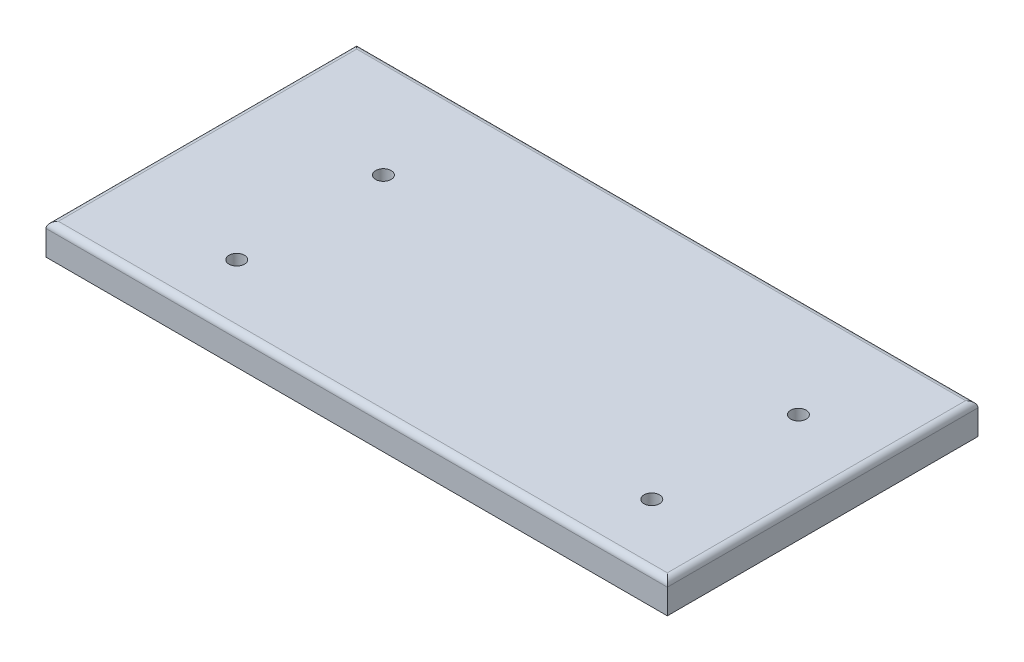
ISO-10303-21;
HEADER;
FILE_DESCRIPTION(('STEP AP214'),'2;1');
FILE_NAME('part.step','',(''),(''),'','','');
FILE_SCHEMA(('AUTOMOTIVE_DESIGN { 1 0 10303 214 1 1 1 1 }'));
ENDSEC;
DATA;
#1=APPLICATION_CONTEXT('core data for automotive mechanical design processes');
#2=APPLICATION_PROTOCOL_DEFINITION('international standard','automotive_design',2000,#1);
#3=PRODUCT_CONTEXT('',#1,'mechanical');
#4=PRODUCT('Part','Part','',(#3));
#5=PRODUCT_RELATED_PRODUCT_CATEGORY('part','',(#4));
#6=PRODUCT_DEFINITION_FORMATION('','',#4);
#7=PRODUCT_DEFINITION_CONTEXT('part definition',#1,'design');
#8=PRODUCT_DEFINITION('design','',#6,#7);
#9=PRODUCT_DEFINITION_SHAPE('','',#8);
#10=(LENGTH_UNIT() NAMED_UNIT(*) SI_UNIT(.MILLI.,.METRE.));
#11=(NAMED_UNIT(*) PLANE_ANGLE_UNIT() SI_UNIT($,.RADIAN.));
#12=(NAMED_UNIT(*) SI_UNIT($,.STERADIAN.) SOLID_ANGLE_UNIT());
#13=UNCERTAINTY_MEASURE_WITH_UNIT(LENGTH_MEASURE(1.E-05),#10,'distance_accuracy_value','');
#14=(GEOMETRIC_REPRESENTATION_CONTEXT(3) GLOBAL_UNCERTAINTY_ASSIGNED_CONTEXT((#13)) GLOBAL_UNIT_ASSIGNED_CONTEXT((#10,
#11,#12)) REPRESENTATION_CONTEXT('',''));
#15=CARTESIAN_POINT('',(0.,0.,0.));
#16=DIRECTION('',(0.,0.,1.));
#17=DIRECTION('',(1.,0.,0.));
#18=AXIS2_PLACEMENT_3D('',#15,#16,#17);
#19=CARTESIAN_POINT('',(0.,12.7,0.));
#20=DIRECTION('',(-1.,0.,0.));
#21=DIRECTION('',(0.,0.,1.));
#22=AXIS2_PLACEMENT_3D('',#19,#20,#21);
#23=PLANE('',#22);
#24=DIRECTION('',(0.,-1.,0.));
#25=VECTOR('',#24,1.);
#26=CARTESIAN_POINT('',(0.,12.7,-127.));
#27=LINE('',#26,#25);
#28=CARTESIAN_POINT('',(0.,10.16,-127.));
#29=VERTEX_POINT('',#28);
#30=CARTESIAN_POINT('',(0.,0.,-127.));
#31=VERTEX_POINT('',#30);
#32=EDGE_CURVE('E81',#29,#31,#27,.T.);
#33=ORIENTED_EDGE('',*,*,#32,.F.);
#34=DIRECTION('',(0.,0.,-1.));
#35=VECTOR('',#34,1.);
#36=CARTESIAN_POINT('',(0.,10.16,0.));
#37=LINE('',#36,#35);
#38=CARTESIAN_POINT('',(0.,10.16,0.));
#39=VERTEX_POINT('',#38);
#40=EDGE_CURVE('E130',#29,#39,#37,.F.);
#41=ORIENTED_EDGE('',*,*,#40,.T.);
#42=DIRECTION('',(0.,-1.,0.));
#43=VECTOR('',#42,1.);
#44=CARTESIAN_POINT('',(0.,12.7,0.));
#45=LINE('',#44,#43);
#46=CARTESIAN_POINT('',(0.,0.,0.));
#47=VERTEX_POINT('',#46);
#48=EDGE_CURVE('E101',#39,#47,#45,.T.);
#49=ORIENTED_EDGE('',*,*,#48,.T.);
#50=DIRECTION('',(0.,0.,-1.));
#51=VECTOR('',#50,1.);
#52=CARTESIAN_POINT('',(0.,0.,0.));
#53=LINE('',#52,#51);
#54=EDGE_CURVE('E96',#47,#31,#53,.T.);
#55=ORIENTED_EDGE('',*,*,#54,.T.);
#56=EDGE_LOOP('',(#33,#41,#49,#55));
#57=FACE_BOUND('',#56,.T.);
#58=ADVANCED_FACE('F30',(#57),#23,.F.);
#59=CARTESIAN_POINT('',(0.,12.7,-127.));
#60=DIRECTION('',(0.,0.,1.));
#61=DIRECTION('',(1.,0.,0.));
#62=AXIS2_PLACEMENT_3D('',#59,#60,#61);
#63=PLANE('',#62);
#64=DIRECTION('',(0.,-1.,0.));
#65=VECTOR('',#64,1.);
#66=CARTESIAN_POINT('',(-254.,12.7,-127.));
#67=LINE('',#66,#65);
#68=CARTESIAN_POINT('',(-254.,10.16,-127.));
#69=VERTEX_POINT('',#68);
#70=CARTESIAN_POINT('',(-254.,0.,-127.));
#71=VERTEX_POINT('',#70);
#72=EDGE_CURVE('E90',#69,#71,#67,.T.);
#73=ORIENTED_EDGE('',*,*,#72,.F.);
#74=DIRECTION('',(-1.,0.,0.));
#75=VECTOR('',#74,1.);
#76=CARTESIAN_POINT('',(0.,10.16,-127.));
#77=LINE('',#76,#75);
#78=EDGE_CURVE('E39',#69,#29,#77,.F.);
#79=ORIENTED_EDGE('',*,*,#78,.T.);
#80=ORIENTED_EDGE('',*,*,#32,.T.);
#81=DIRECTION('',(-1.,0.,0.));
#82=VECTOR('',#81,1.);
#83=CARTESIAN_POINT('',(0.,0.,-127.));
#84=LINE('',#83,#82);
#85=EDGE_CURVE('E84',#31,#71,#84,.T.);
#86=ORIENTED_EDGE('',*,*,#85,.T.);
#87=EDGE_LOOP('',(#73,#79,#80,#86));
#88=FACE_BOUND('',#87,.T.);
#89=ADVANCED_FACE('F83',(#88),#63,.F.);
#90=CARTESIAN_POINT('',(-254.,12.7,0.));
#91=DIRECTION('',(1.,0.,0.));
#92=DIRECTION('',(0.,0.,-1.));
#93=AXIS2_PLACEMENT_3D('',#90,#91,#92);
#94=PLANE('',#93);
#95=DIRECTION('',(0.,-1.,0.));
#96=VECTOR('',#95,1.);
#97=CARTESIAN_POINT('',(-254.,12.7,0.));
#98=LINE('',#97,#96);
#99=CARTESIAN_POINT('',(-254.,10.16,0.));
#100=VERTEX_POINT('',#99);
#101=CARTESIAN_POINT('',(-254.,0.,0.));
#102=VERTEX_POINT('',#101);
#103=EDGE_CURVE('E116',#100,#102,#98,.T.);
#104=ORIENTED_EDGE('',*,*,#103,.F.);
#105=DIRECTION('',(0.,0.,1.));
#106=VECTOR('',#105,1.);
#107=CARTESIAN_POINT('',(-254.,10.16,-127.));
#108=LINE('',#107,#106);
#109=EDGE_CURVE('E11',#100,#69,#108,.F.);
#110=ORIENTED_EDGE('',*,*,#109,.T.);
#111=ORIENTED_EDGE('',*,*,#72,.T.);
#112=DIRECTION('',(0.,0.,1.));
#113=VECTOR('',#112,1.);
#114=CARTESIAN_POINT('',(-254.,0.,0.));
#115=LINE('',#114,#113);
#116=EDGE_CURVE('E98',#71,#102,#115,.T.);
#117=ORIENTED_EDGE('',*,*,#116,.T.);
#118=EDGE_LOOP('',(#104,#110,#111,#117));
#119=FACE_BOUND('',#118,.T.);
#120=ADVANCED_FACE('F180',(#119),#94,.F.);
#121=CARTESIAN_POINT('',(0.,12.7,0.));
#122=DIRECTION('',(0.,0.,-1.));
#123=DIRECTION('',(-1.,0.,0.));
#124=AXIS2_PLACEMENT_3D('',#121,#122,#123);
#125=PLANE('',#124);
#126=ORIENTED_EDGE('',*,*,#48,.F.);
#127=DIRECTION('',(1.,0.,0.));
#128=VECTOR('',#127,1.);
#129=CARTESIAN_POINT('',(-254.,10.16,0.));
#130=LINE('',#129,#128);
#131=EDGE_CURVE('E127',#39,#100,#130,.F.);
#132=ORIENTED_EDGE('',*,*,#131,.T.);
#133=ORIENTED_EDGE('',*,*,#103,.T.);
#134=DIRECTION('',(1.,0.,0.));
#135=VECTOR('',#134,1.);
#136=CARTESIAN_POINT('',(0.,0.,0.));
#137=LINE('',#136,#135);
#138=EDGE_CURVE('E113',#102,#47,#137,.T.);
#139=ORIENTED_EDGE('',*,*,#138,.T.);
#140=EDGE_LOOP('',(#126,#132,#133,#139));
#141=FACE_BOUND('',#140,.T.);
#142=ADVANCED_FACE('F208',(#141),#125,.F.);
#143=CARTESIAN_POINT('',(0.,12.7,-127.));
#144=DIRECTION('',(0.,1.,0.));
#145=DIRECTION('',(0.,0.,1.));
#146=AXIS2_PLACEMENT_3D('',#143,#144,#145);
#147=PLANE('',#146);
#148=CARTESIAN_POINT('',(-201.422,12.7,-85.344));
#149=DIRECTION('',(0.,1.,0.));
#150=DIRECTION('',(0.,0.,1.));
#151=AXIS2_PLACEMENT_3D('',#148,#149,#150);
#152=CIRCLE('',#151,3.17499999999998);
#153=CARTESIAN_POINT('',(-201.422,12.7,-82.169));
#154=VERTEX_POINT('',#153);
#155=EDGE_CURVE('E156',#154,#154,#152,.T.);
#156=ORIENTED_EDGE('',*,*,#155,.F.);
#157=EDGE_LOOP('',(#156));
#158=FACE_BOUND('',#157,.T.);
#159=CARTESIAN_POINT('',(-31.75,12.7,-85.344));
#160=DIRECTION('',(0.,1.,0.));
#161=DIRECTION('',(0.,0.,1.));
#162=AXIS2_PLACEMENT_3D('',#159,#160,#161);
#163=CIRCLE('',#162,3.175);
#164=CARTESIAN_POINT('',(-31.75,12.7,-82.169));
#165=VERTEX_POINT('',#164);
#166=EDGE_CURVE('E151',#165,#165,#163,.T.);
#167=ORIENTED_EDGE('',*,*,#166,.F.);
#168=EDGE_LOOP('',(#167));
#169=FACE_BOUND('',#168,.T.);
#170=CARTESIAN_POINT('',(-31.75,12.7,-25.4));
#171=DIRECTION('',(0.,1.,0.));
#172=DIRECTION('',(0.,0.,1.));
#173=AXIS2_PLACEMENT_3D('',#170,#171,#172);
#174=CIRCLE('',#173,3.175);
#175=CARTESIAN_POINT('',(-31.75,12.7,-22.225));
#176=VERTEX_POINT('',#175);
#177=EDGE_CURVE('E141',#176,#176,#174,.T.);
#178=ORIENTED_EDGE('',*,*,#177,.F.);
#179=EDGE_LOOP('',(#178));
#180=FACE_BOUND('',#179,.T.);
#181=CARTESIAN_POINT('',(-201.422,12.7,-25.4));
#182=DIRECTION('',(0.,1.,0.));
#183=DIRECTION('',(0.,0.,1.));
#184=AXIS2_PLACEMENT_3D('',#181,#182,#183);
#185=CIRCLE('',#184,3.17499999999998);
#186=CARTESIAN_POINT('',(-201.422,12.7,-22.225));
#187=VERTEX_POINT('',#186);
#188=EDGE_CURVE('E140',#187,#187,#185,.T.);
#189=ORIENTED_EDGE('',*,*,#188,.F.);
#190=EDGE_LOOP('',(#189));
#191=FACE_BOUND('',#190,.T.);
#192=DIRECTION('',(0.,0.,1.));
#193=VECTOR('',#192,1.);
#194=CARTESIAN_POINT('',(-251.46,12.7,0.));
#195=LINE('',#194,#193);
#196=CARTESIAN_POINT('',(-251.46,12.7,-124.46));
#197=VERTEX_POINT('',#196);
#198=CARTESIAN_POINT('',(-251.46,12.7,-2.53999999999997));
#199=VERTEX_POINT('',#198);
#200=EDGE_CURVE('E89',#197,#199,#195,.T.);
#201=ORIENTED_EDGE('',*,*,#200,.T.);
#202=DIRECTION('',(1.,0.,0.));
#203=VECTOR('',#202,1.);
#204=CARTESIAN_POINT('',(0.,12.7,-2.54));
#205=LINE('',#204,#203);
#206=CARTESIAN_POINT('',(-2.54,12.7,-2.54));
#207=VERTEX_POINT('',#206);
#208=EDGE_CURVE('E124',#199,#207,#205,.T.);
#209=ORIENTED_EDGE('',*,*,#208,.T.);
#210=DIRECTION('',(0.,0.,-1.));
#211=VECTOR('',#210,1.);
#212=CARTESIAN_POINT('',(-2.54,12.7,-127.));
#213=LINE('',#212,#211);
#214=CARTESIAN_POINT('',(-2.54,12.7,-124.46));
#215=VERTEX_POINT('',#214);
#216=EDGE_CURVE('E122',#207,#215,#213,.T.);
#217=ORIENTED_EDGE('',*,*,#216,.T.);
#218=DIRECTION('',(-1.,0.,0.));
#219=VECTOR('',#218,1.);
#220=CARTESIAN_POINT('',(-254.,12.7,-124.46));
#221=LINE('',#220,#219);
#222=EDGE_CURVE('E120',#215,#197,#221,.T.);
#223=ORIENTED_EDGE('',*,*,#222,.T.);
#224=EDGE_LOOP('',(#201,#209,#217,#223));
#225=FACE_BOUND('',#224,.T.);
#226=ADVANCED_FACE('F211',(#158,#169,#180,#191,#225),#147,.T.);
#227=CARTESIAN_POINT('',(0.,0.,-127.));
#228=DIRECTION('',(0.,1.,0.));
#229=DIRECTION('',(0.,0.,1.));
#230=AXIS2_PLACEMENT_3D('',#227,#228,#229);
#231=PLANE('',#230);
#232=CARTESIAN_POINT('',(-201.422,0.,-85.344));
#233=DIRECTION('',(0.,1.,0.));
#234=DIRECTION('',(0.,0.,1.));
#235=AXIS2_PLACEMENT_3D('',#232,#233,#234);
#236=CIRCLE('',#235,3.17499999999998);
#237=CARTESIAN_POINT('',(-201.422,0.,-82.169));
#238=VERTEX_POINT('',#237);
#239=EDGE_CURVE('E34',#238,#238,#236,.T.);
#240=ORIENTED_EDGE('',*,*,#239,.T.);
#241=EDGE_LOOP('',(#240));
#242=FACE_BOUND('',#241,.T.);
#243=CARTESIAN_POINT('',(-31.75,0.,-85.344));
#244=DIRECTION('',(0.,1.,0.));
#245=DIRECTION('',(0.,0.,1.));
#246=AXIS2_PLACEMENT_3D('',#243,#244,#245);
#247=CIRCLE('',#246,3.175);
#248=CARTESIAN_POINT('',(-31.75,0.,-82.169));
#249=VERTEX_POINT('',#248);
#250=EDGE_CURVE('E146',#249,#249,#247,.T.);
#251=ORIENTED_EDGE('',*,*,#250,.T.);
#252=EDGE_LOOP('',(#251));
#253=FACE_BOUND('',#252,.T.);
#254=CARTESIAN_POINT('',(-31.75,0.,-25.4));
#255=DIRECTION('',(0.,1.,0.));
#256=DIRECTION('',(0.,0.,1.));
#257=AXIS2_PLACEMENT_3D('',#254,#255,#256);
#258=CIRCLE('',#257,3.175);
#259=CARTESIAN_POINT('',(-31.75,0.,-22.225));
#260=VERTEX_POINT('',#259);
#261=EDGE_CURVE('E138',#260,#260,#258,.T.);
#262=ORIENTED_EDGE('',*,*,#261,.T.);
#263=EDGE_LOOP('',(#262));
#264=FACE_BOUND('',#263,.T.);
#265=CARTESIAN_POINT('',(-201.422,0.,-25.4));
#266=DIRECTION('',(0.,1.,0.));
#267=DIRECTION('',(0.,0.,1.));
#268=AXIS2_PLACEMENT_3D('',#265,#266,#267);
#269=CIRCLE('',#268,3.17499999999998);
#270=CARTESIAN_POINT('',(-201.422,0.,-22.225));
#271=VERTEX_POINT('',#270);
#272=EDGE_CURVE('E109',#271,#271,#269,.T.);
#273=ORIENTED_EDGE('',*,*,#272,.T.);
#274=EDGE_LOOP('',(#273));
#275=FACE_BOUND('',#274,.T.);
#276=ORIENTED_EDGE('',*,*,#54,.F.);
#277=ORIENTED_EDGE('',*,*,#138,.F.);
#278=ORIENTED_EDGE('',*,*,#116,.F.);
#279=ORIENTED_EDGE('',*,*,#85,.F.);
#280=EDGE_LOOP('',(#276,#277,#278,#279));
#281=FACE_BOUND('',#280,.T.);
#282=ADVANCED_FACE('F94',(#242,#253,#264,#275,#281),#231,.F.);
#283=CARTESIAN_POINT('',(0.,10.16,-124.46));
#284=DIRECTION('',(1.,0.,0.));
#285=DIRECTION('',(0.,0.,-1.));
#286=AXIS2_PLACEMENT_3D('',#283,#284,#285);
#287=CYLINDRICAL_SURFACE('',#286,2.54);
#288=CARTESIAN_POINT('',(-2.54,10.16,-124.46));
#289=DIRECTION('',(0.707106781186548,0.,0.707106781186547));
#290=DIRECTION('',(0.707106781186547,0.,-0.707106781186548));
#291=AXIS2_PLACEMENT_3D('',#288,#289,#290);
#292=ELLIPSE('',#291,3.59210244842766,2.54);
#293=EDGE_CURVE('E106',#29,#215,#292,.T.);
#294=ORIENTED_EDGE('',*,*,#293,.F.);
#295=ORIENTED_EDGE('',*,*,#78,.F.);
#296=CARTESIAN_POINT('',(-251.46,10.16,-124.46));
#297=DIRECTION('',(0.707106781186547,0.,-0.707106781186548));
#298=DIRECTION('',(-0.707106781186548,0.,-0.707106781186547));
#299=AXIS2_PLACEMENT_3D('',#296,#297,#298);
#300=ELLIPSE('',#299,3.59210244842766,2.54);
#301=EDGE_CURVE('E103',#197,#69,#300,.F.);
#302=ORIENTED_EDGE('',*,*,#301,.F.);
#303=ORIENTED_EDGE('',*,*,#222,.F.);
#304=EDGE_LOOP('',(#294,#295,#302,#303));
#305=FACE_BOUND('',#304,.T.);
#306=ADVANCED_FACE('F32',(#305),#287,.T.);
#307=CARTESIAN_POINT('',(-251.46,10.16,-127.));
#308=DIRECTION('',(0.,0.,-1.));
#309=DIRECTION('',(-1.,0.,0.));
#310=AXIS2_PLACEMENT_3D('',#307,#308,#309);
#311=CYLINDRICAL_SURFACE('',#310,2.54);
#312=ORIENTED_EDGE('',*,*,#301,.T.);
#313=ORIENTED_EDGE('',*,*,#109,.F.);
#314=CARTESIAN_POINT('',(-251.46,10.16,-2.53999999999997));
#315=DIRECTION('',(-0.707106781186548,0.,-0.707106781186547));
#316=DIRECTION('',(0.707106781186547,0.,-0.707106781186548));
#317=AXIS2_PLACEMENT_3D('',#314,#315,#316);
#318=ELLIPSE('',#317,3.59210244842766,2.54);
#319=EDGE_CURVE('E135',#199,#100,#318,.F.);
#320=ORIENTED_EDGE('',*,*,#319,.F.);
#321=ORIENTED_EDGE('',*,*,#200,.F.);
#322=EDGE_LOOP('',(#312,#313,#320,#321));
#323=FACE_BOUND('',#322,.T.);
#324=ADVANCED_FACE('F191',(#323),#311,.T.);
#325=CARTESIAN_POINT('',(-2.54,10.16,-127.));
#326=DIRECTION('',(0.,0.,1.));
#327=DIRECTION('',(1.,0.,0.));
#328=AXIS2_PLACEMENT_3D('',#325,#326,#327);
#329=CYLINDRICAL_SURFACE('',#328,2.54);
#330=ORIENTED_EDGE('',*,*,#293,.T.);
#331=ORIENTED_EDGE('',*,*,#216,.F.);
#332=CARTESIAN_POINT('',(-2.54,10.16,-2.54));
#333=DIRECTION('',(-0.707106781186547,0.,0.707106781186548));
#334=DIRECTION('',(0.707106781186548,0.,0.707106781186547));
#335=AXIS2_PLACEMENT_3D('',#332,#333,#334);
#336=ELLIPSE('',#335,3.59210244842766,2.54);
#337=EDGE_CURVE('E133',#39,#207,#336,.T.);
#338=ORIENTED_EDGE('',*,*,#337,.F.);
#339=ORIENTED_EDGE('',*,*,#40,.F.);
#340=EDGE_LOOP('',(#330,#331,#338,#339));
#341=FACE_BOUND('',#340,.T.);
#342=ADVANCED_FACE('F188',(#341),#329,.T.);
#343=CARTESIAN_POINT('',(0.,10.16,-2.54));
#344=DIRECTION('',(-1.,0.,0.));
#345=DIRECTION('',(0.,0.,1.));
#346=AXIS2_PLACEMENT_3D('',#343,#344,#345);
#347=CYLINDRICAL_SURFACE('',#346,2.54);
#348=ORIENTED_EDGE('',*,*,#319,.T.);
#349=ORIENTED_EDGE('',*,*,#131,.F.);
#350=ORIENTED_EDGE('',*,*,#337,.T.);
#351=ORIENTED_EDGE('',*,*,#208,.F.);
#352=EDGE_LOOP('',(#348,#349,#350,#351));
#353=FACE_BOUND('',#352,.T.);
#354=ADVANCED_FACE('F184',(#353),#347,.T.);
#355=CARTESIAN_POINT('',(-201.422,12.7,-25.4));
#356=DIRECTION('',(0.,1.,0.));
#357=DIRECTION('',(0.,0.,1.));
#358=AXIS2_PLACEMENT_3D('',#355,#356,#357);
#359=CYLINDRICAL_SURFACE('',#358,3.17499999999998);
#360=ORIENTED_EDGE('',*,*,#188,.T.);
#361=EDGE_LOOP('',(#360));
#362=FACE_BOUND('',#361,.T.);
#363=ORIENTED_EDGE('',*,*,#272,.F.);
#364=EDGE_LOOP('',(#363));
#365=FACE_BOUND('',#364,.T.);
#366=ADVANCED_FACE('F187',(#362,#365),#359,.F.);
#367=CARTESIAN_POINT('',(-31.75,12.7,-25.4));
#368=DIRECTION('',(0.,1.,0.));
#369=DIRECTION('',(0.,0.,1.));
#370=AXIS2_PLACEMENT_3D('',#367,#368,#369);
#371=CYLINDRICAL_SURFACE('',#370,3.175);
#372=ORIENTED_EDGE('',*,*,#177,.T.);
#373=EDGE_LOOP('',(#372));
#374=FACE_BOUND('',#373,.T.);
#375=ORIENTED_EDGE('',*,*,#261,.F.);
#376=EDGE_LOOP('',(#375));
#377=FACE_BOUND('',#376,.T.);
#378=ADVANCED_FACE('F172',(#374,#377),#371,.F.);
#379=CARTESIAN_POINT('',(-31.75,12.7,-85.344));
#380=DIRECTION('',(0.,1.,0.));
#381=DIRECTION('',(0.,0.,1.));
#382=AXIS2_PLACEMENT_3D('',#379,#380,#381);
#383=CYLINDRICAL_SURFACE('',#382,3.175);
#384=ORIENTED_EDGE('',*,*,#166,.T.);
#385=EDGE_LOOP('',(#384));
#386=FACE_BOUND('',#385,.T.);
#387=ORIENTED_EDGE('',*,*,#250,.F.);
#388=EDGE_LOOP('',(#387));
#389=FACE_BOUND('',#388,.T.);
#390=ADVANCED_FACE('F167',(#386,#389),#383,.F.);
#391=CARTESIAN_POINT('',(-201.422,12.7,-85.344));
#392=DIRECTION('',(0.,1.,0.));
#393=DIRECTION('',(0.,0.,1.));
#394=AXIS2_PLACEMENT_3D('',#391,#392,#393);
#395=CYLINDRICAL_SURFACE('',#394,3.17499999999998);
#396=ORIENTED_EDGE('',*,*,#155,.T.);
#397=EDGE_LOOP('',(#396));
#398=FACE_BOUND('',#397,.T.);
#399=ORIENTED_EDGE('',*,*,#239,.F.);
#400=EDGE_LOOP('',(#399));
#401=FACE_BOUND('',#400,.T.);
#402=ADVANCED_FACE('F165',(#398,#401),#395,.F.);
#403=CLOSED_SHELL('',(#58,#89,#120,#142,#226,#282,#306,#324,#342,#354,#366,#378,#390,#402));
#404=MANIFOLD_SOLID_BREP('B2',#403);
#405=ADVANCED_BREP_SHAPE_REPRESENTATION('',(#18,#404),#14);
#406=SHAPE_DEFINITION_REPRESENTATION(#9,#405);
ENDSEC;
END-ISO-10303-21;
